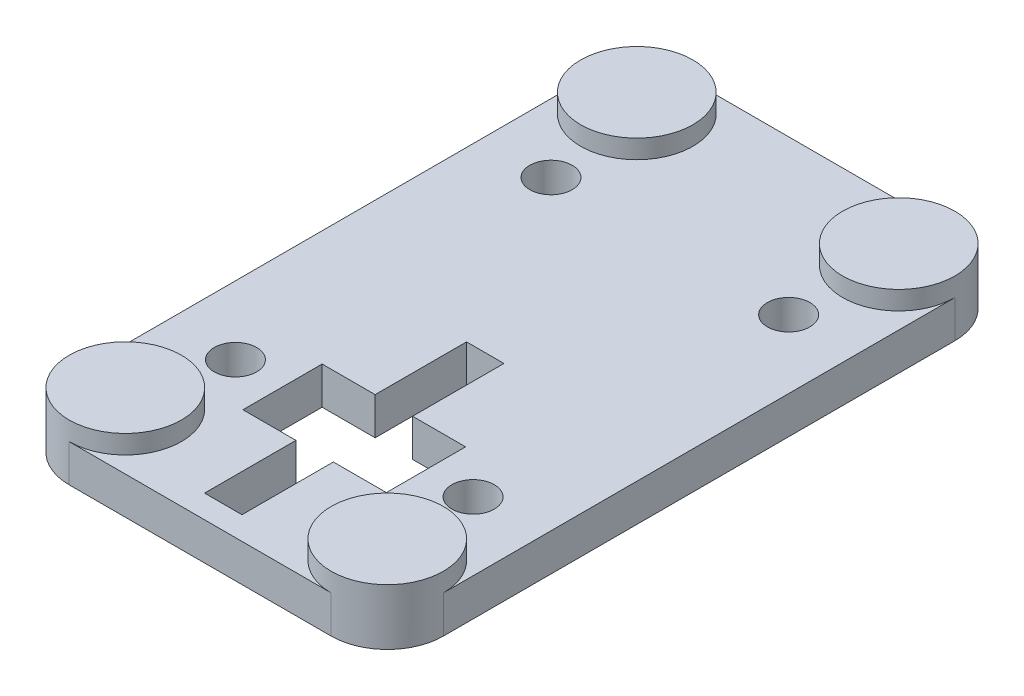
from build123d import *

# Parameters (mm, degrees)
CROQUIS1_W                 = 30
CROQUIS1_H                 = 50
CROQUIS1_R                 = 3.25
SALIENTE_EXTRUIR1_DEPTH    = 3
CROQUIS2_R                 = 4.5
SALIENTE_EXTRUIR2_DEPTH    = 1.5
CORTAR_EXTRUIR1_DEPTH      = 59.386642
CORTAR_EXTRUIR1_DEPTH_BACK = 59.386642
CORTAR_EXTRUIR2_DEPTH      = 59.482903
CORTAR_EXTRUIR2_DEPTH_BACK = 59.482903
CROQUIS5_W                 = 11.5
CROQUIS5_H                 = 6.35
CORTAR_EXTRUIR3_DEPTH      = 59.386642
CORTAR_EXTRUIR3_DEPTH_BACK = 59.386642
CROQUIS6_R                 = 1.7
CORTAR_EXTRUIR4_DEPTH      = 59.482903
CORTAR_EXTRUIR4_DEPTH_BACK = 59.482903
CROQUIS7_R                 = 1.7
CORTAR_EXTRUIR5_DEPTH      = 59.482903
CORTAR_EXTRUIR5_DEPTH_BACK = 59.482903
CROQUIS8_W                 = 3
CROQUIS8_H                 = 21


with BuildPart() as part:
    # Croquis1 → Saliente-Extruir1 (new body)
    with BuildSketch(Plane(origin=(0, 0, 0), x_dir=(1, 0, 0), z_dir=(0, 1, 0))):
        with Locations((15, 25)):
            Rectangle(CROQUIS1_W, CROQUIS1_H)
        with Locations(Location((25.5, 45.5, 0), (0, 0, 270))):
            Circle(CROQUIS1_R, mode=Mode.SUBTRACT)
        with Locations(Location((4.5, 45.5, 0), (0, 0, 90))):
            Circle(CROQUIS1_R, mode=Mode.SUBTRACT)
        with Locations(Location((25.5, 4.5, 0), (0, 0, 90))):
            Circle(CROQUIS1_R, mode=Mode.SUBTRACT)
        with Locations(Location((4.5, 4.5, 0), (0, 0, 270))):
            Circle(CROQUIS1_R, mode=Mode.SUBTRACT)
    extrude(amount=SALIENTE_EXTRUIR1_DEPTH)

    # Croquis2 → Saliente-Extruir2 (add)
    with BuildSketch(Plane(origin=(0, 3, 0), x_dir=(1, 0, 0), z_dir=(0, 1, 0))):
        with Locations(Location((4.5, 45.5, 0), (0, 0, 90))):
            Circle(CROQUIS2_R)
        with Locations(Location((25.5, 45.5, 0), (0, 0, 90))):
            Circle(CROQUIS2_R)
        with Locations(Location((4.5, 4.5, 0), (0, 0, 270))):
            Circle(CROQUIS2_R)
        with Locations(Location((25.5, 4.5, 0), (0, 0, 270))):
            Circle(CROQUIS2_R)
    extrude(amount=SALIENTE_EXTRUIR2_DEPTH)

    # Croquis4 → Cortar-Extruir1 (cut, two sides: drawn at the far end of the back side and taken through both)
    with BuildSketch(Plane(origin=(0, 3, 0), x_dir=(1, 0, 0), z_dir=(0, 1, 0)).offset(-CORTAR_EXTRUIR1_DEPTH_BACK)):
        with BuildLine():
            Line((4.5, 50), (0, 50))
            Line((0, 50), (0, 45.5))
            ThreePointArc((0, 45.5), (1.318019, 48.681981), (4.5, 50))
        make_face()
        with BuildLine():
            Line((30, 50), (25.5, 50))
            ThreePointArc((25.5, 50), (28.681981, 48.681981), (30, 45.5))
            Line((30, 45.5), (30, 50))
        make_face()
        with BuildLine():
            Line((30, 0), (30, 4.5))
            ThreePointArc((30, 4.5), (28.681981, 1.318019), (25.5, 0))
            Line((25.5, 0), (30, 0))
        make_face()
        with BuildLine():
            Line((0, 0), (4.5, 0))
            ThreePointArc((4.5, 0), (1.318019, 1.318019), (0, 4.5))
            Line((0, 4.5), (0, 0))
        make_face()
    extrude(amount=CORTAR_EXTRUIR1_DEPTH + CORTAR_EXTRUIR1_DEPTH_BACK, mode=Mode.SUBTRACT)

    # Croquis5 → Cortar-Extruir2 (cut, two sides: drawn at the far end of the back side and taken through both)
    with BuildSketch(Plane.XZ.offset(-CORTAR_EXTRUIR2_DEPTH_BACK)):
        with Locations((15, -12.352395)):
            Rectangle(CROQUIS5_W, CROQUIS5_H)
    extrude(amount=CORTAR_EXTRUIR2_DEPTH + CORTAR_EXTRUIR2_DEPTH_BACK, mode=Mode.SUBTRACT)

    # Croquis6 → Cortar-Extruir3 (cut, two sides: drawn at the far end of the back side and taken through both)
    with BuildSketch(Plane(origin=(0, 3, 0), x_dir=(1, 0, 0), z_dir=(0, 1, 0)).offset(-CORTAR_EXTRUIR3_DEPTH_BACK)):
        with Locations(Location((24.525, 12.352395, 0), (0, 0, 270))):
            Circle(CROQUIS6_R)
        with Locations(Location((5.475, 12.352395, 0), (0, 0, 270))):
            Circle(CROQUIS6_R)
    extrude(amount=CORTAR_EXTRUIR3_DEPTH + CORTAR_EXTRUIR3_DEPTH_BACK, mode=Mode.SUBTRACT)

    # Croquis7 → Cortar-Extruir4 (cut, two sides: drawn at the far end of the back side and taken through both)
    with BuildSketch(Plane.XZ.offset(-CORTAR_EXTRUIR4_DEPTH_BACK)):
        with Locations(Location((5.475, -37.647605, 0), (0, 0, 90))):
            Circle(CROQUIS7_R)
        with Locations(Location((24.525, -37.647605, 0), (0, 0, 90))):
            Circle(CROQUIS7_R)
    extrude(amount=CORTAR_EXTRUIR4_DEPTH + CORTAR_EXTRUIR4_DEPTH_BACK, mode=Mode.SUBTRACT)

    # Croquis8 → Cortar-Extruir5 (cut, two sides: drawn at the far end of the back side and taken through both)
    with BuildSketch(Plane.XZ.offset(-CORTAR_EXTRUIR5_DEPTH_BACK)):
        with Locations((15, -12.352395)):
            Rectangle(CROQUIS8_W, CROQUIS8_H)
    extrude(amount=CORTAR_EXTRUIR5_DEPTH + CORTAR_EXTRUIR5_DEPTH_BACK, mode=Mode.SUBTRACT)


solid = part.part
